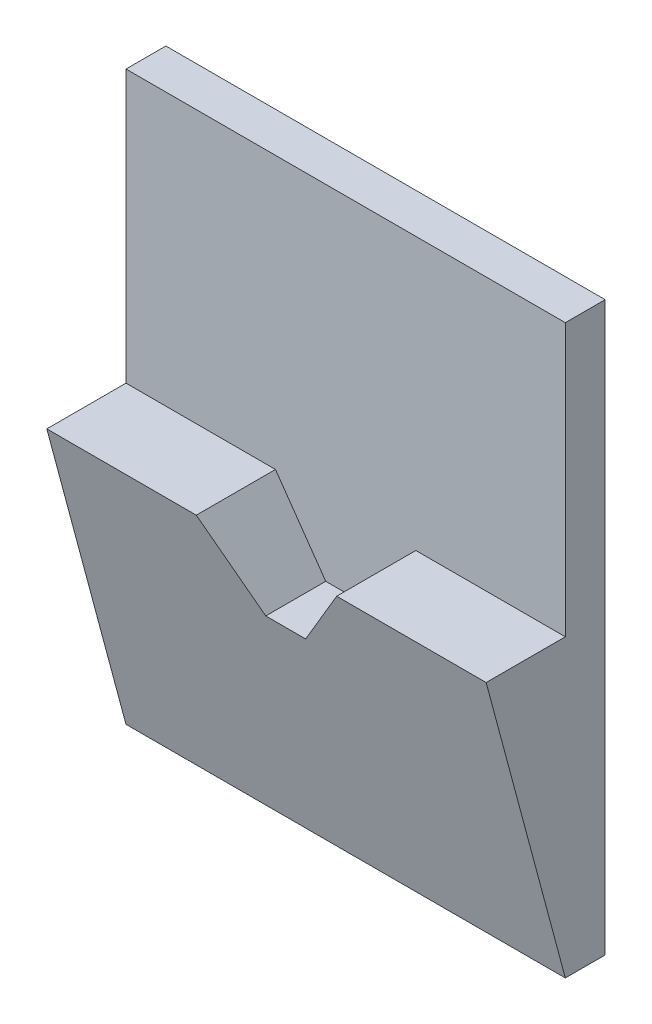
ISO-10303-21;
HEADER;
FILE_DESCRIPTION(('STEP AP214'),'2;1');
FILE_NAME('part.step','',(''),(''),'','','');
FILE_SCHEMA(('AUTOMOTIVE_DESIGN { 1 0 10303 214 1 1 1 1 }'));
ENDSEC;
DATA;
#1=APPLICATION_CONTEXT('core data for automotive mechanical design processes');
#2=APPLICATION_PROTOCOL_DEFINITION('international standard','automotive_design',2000,#1);
#3=PRODUCT_CONTEXT('',#1,'mechanical');
#4=PRODUCT('Part','Part','',(#3));
#5=PRODUCT_RELATED_PRODUCT_CATEGORY('part','',(#4));
#6=PRODUCT_DEFINITION_FORMATION('','',#4);
#7=PRODUCT_DEFINITION_CONTEXT('part definition',#1,'design');
#8=PRODUCT_DEFINITION('design','',#6,#7);
#9=PRODUCT_DEFINITION_SHAPE('','',#8);
#10=(LENGTH_UNIT() NAMED_UNIT(*) SI_UNIT(.MILLI.,.METRE.));
#11=(NAMED_UNIT(*) PLANE_ANGLE_UNIT() SI_UNIT($,.RADIAN.));
#12=(NAMED_UNIT(*) SI_UNIT($,.STERADIAN.) SOLID_ANGLE_UNIT());
#13=UNCERTAINTY_MEASURE_WITH_UNIT(LENGTH_MEASURE(1.E-05),#10,'distance_accuracy_value','');
#14=(GEOMETRIC_REPRESENTATION_CONTEXT(3) GLOBAL_UNCERTAINTY_ASSIGNED_CONTEXT((#13)) GLOBAL_UNIT_ASSIGNED_CONTEXT((#10,
#11,#12)) REPRESENTATION_CONTEXT('',''));
#15=CARTESIAN_POINT('',(0.,0.,0.));
#16=DIRECTION('',(0.,0.,1.));
#17=DIRECTION('',(1.,0.,0.));
#18=AXIS2_PLACEMENT_3D('',#15,#16,#17);
#19=CARTESIAN_POINT('',(-57.1808976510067,0.,5.08));
#20=DIRECTION('',(0.,1.,0.));
#21=DIRECTION('',(-1.,0.,0.));
#22=AXIS2_PLACEMENT_3D('',#19,#20,#21);
#23=PLANE('',#22);
#24=DIRECTION('',(-1.,0.,0.));
#25=VECTOR('',#24,1.);
#26=CARTESIAN_POINT('',(-57.1808976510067,0.,5.08));
#27=LINE('',#26,#25);
#28=CARTESIAN_POINT('',(-19.0808976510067,0.,5.08));
#29=VERTEX_POINT('',#28);
#30=CARTESIAN_POINT('',(-57.1808976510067,0.,5.08));
#31=VERTEX_POINT('',#30);
#32=EDGE_CURVE('E164',#29,#31,#27,.T.);
#33=ORIENTED_EDGE('',*,*,#32,.T.);
#34=DIRECTION('',(0.,0.,1.));
#35=VECTOR('',#34,1.);
#36=CARTESIAN_POINT('',(-57.1808976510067,0.,5.08));
#37=LINE('',#36,#35);
#38=CARTESIAN_POINT('',(-57.1808976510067,0.,25.2596358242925));
#39=VERTEX_POINT('',#38);
#40=EDGE_CURVE('E44',#31,#39,#37,.T.);
#41=ORIENTED_EDGE('',*,*,#40,.T.);
#42=DIRECTION('',(-1.,0.,0.));
#43=VECTOR('',#42,1.);
#44=CARTESIAN_POINT('',(-57.1808976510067,0.,25.2596358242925));
#45=LINE('',#44,#43);
#46=CARTESIAN_POINT('',(-19.0808976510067,0.,25.2596358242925));
#47=VERTEX_POINT('',#46);
#48=EDGE_CURVE('E151',#47,#39,#45,.T.);
#49=ORIENTED_EDGE('',*,*,#48,.F.);
#50=DIRECTION('',(0.,0.,1.));
#51=VECTOR('',#50,1.);
#52=CARTESIAN_POINT('',(-19.0808976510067,0.,5.08));
#53=LINE('',#52,#51);
#54=EDGE_CURVE('E152',#29,#47,#53,.T.);
#55=ORIENTED_EDGE('',*,*,#54,.F.);
#56=EDGE_LOOP('',(#33,#41,#49,#55));
#57=FACE_BOUND('',#56,.T.);
#58=ADVANCED_FACE('F37',(#57),#23,.T.);
#59=CARTESIAN_POINT('',(3.76938179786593,-32.6335810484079,5.08));
#60=DIRECTION('',(0.819152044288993,0.573576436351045,0.));
#61=DIRECTION('',(-0.573576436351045,0.819152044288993,0.));
#62=AXIS2_PLACEMENT_3D('',#59,#60,#61);
#63=PLANE('',#62);
#64=DIRECTION('',(-0.573576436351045,0.819152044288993,0.));
#65=VECTOR('',#64,1.);
#66=CARTESIAN_POINT('',(3.76938179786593,-32.6335810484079,5.08));
#67=LINE('',#66,#65);
#68=CARTESIAN_POINT('',(-6.27541946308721,-18.2881181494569,5.08));
#69=VERTEX_POINT('',#68);
#70=EDGE_CURVE('E168',#69,#29,#67,.T.);
#71=ORIENTED_EDGE('',*,*,#70,.T.);
#72=ORIENTED_EDGE('',*,*,#54,.T.);
#73=DIRECTION('',(-0.56024001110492,0.800105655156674,0.214387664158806));
#74=VECTOR('',#73,1.);
#75=CARTESIAN_POINT('',(5.14288238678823,-34.5951431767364,15.9898951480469));
#76=LINE('',#75,#74);
#77=CARTESIAN_POINT('',(-6.2754194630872,-18.2881181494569,20.3593493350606));
#78=VERTEX_POINT('',#77);
#79=EDGE_CURVE('E144',#78,#47,#76,.T.);
#80=ORIENTED_EDGE('',*,*,#79,.F.);
#81=DIRECTION('',(0.,0.,1.));
#82=VECTOR('',#81,1.);
#83=CARTESIAN_POINT('',(-6.27541946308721,-18.2881181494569,5.08));
#84=LINE('',#83,#82);
#85=EDGE_CURVE('E131',#69,#78,#84,.T.);
#86=ORIENTED_EDGE('',*,*,#85,.F.);
#87=EDGE_LOOP('',(#71,#72,#80,#86));
#88=FACE_BOUND('',#87,.T.);
#89=ADVANCED_FACE('F231',(#88),#63,.T.);
#90=CARTESIAN_POINT('',(-57.1808976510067,-18.2881181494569,5.08));
#91=DIRECTION('',(0.,1.,0.));
#92=DIRECTION('',(-1.,0.,0.));
#93=AXIS2_PLACEMENT_3D('',#90,#91,#92);
#94=PLANE('',#93);
#95=DIRECTION('',(-1.,0.,0.));
#96=VECTOR('',#95,1.);
#97=CARTESIAN_POINT('',(-57.1808976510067,-18.2881181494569,5.08));
#98=LINE('',#97,#96);
#99=CARTESIAN_POINT('',(3.88458053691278,-18.2881181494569,5.08));
#100=VERTEX_POINT('',#99);
#101=EDGE_CURVE('E201',#100,#69,#98,.T.);
#102=ORIENTED_EDGE('',*,*,#101,.T.);
#103=ORIENTED_EDGE('',*,*,#85,.T.);
#104=DIRECTION('',(-1.,0.,0.));
#105=VECTOR('',#104,1.);
#106=CARTESIAN_POINT('',(-57.1808976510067,-18.2881181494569,20.3593493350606));
#107=LINE('',#106,#105);
#108=CARTESIAN_POINT('',(3.88458053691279,-18.2881181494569,20.3593493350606));
#109=VERTEX_POINT('',#108);
#110=EDGE_CURVE('E126',#109,#78,#107,.T.);
#111=ORIENTED_EDGE('',*,*,#110,.F.);
#112=DIRECTION('',(0.,0.,1.));
#113=VECTOR('',#112,1.);
#114=CARTESIAN_POINT('',(3.88458053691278,-18.2881181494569,5.08));
#115=LINE('',#114,#113);
#116=EDGE_CURVE('E129',#100,#109,#115,.T.);
#117=ORIENTED_EDGE('',*,*,#116,.F.);
#118=EDGE_LOOP('',(#102,#103,#111,#117));
#119=FACE_BOUND('',#118,.T.);
#120=ADVANCED_FACE('F128',(#119),#94,.T.);
#121=CARTESIAN_POINT('',(-42.9975376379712,-85.2427217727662,5.08));
#122=DIRECTION('',(-0.819152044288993,0.573576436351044,0.));
#123=DIRECTION('',(-0.573576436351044,-0.819152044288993,0.));
#124=AXIS2_PLACEMENT_3D('',#121,#122,#123);
#125=PLANE('',#124);
#126=DIRECTION('',(-0.573576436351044,-0.819152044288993,0.));
#127=VECTOR('',#126,1.);
#128=CARTESIAN_POINT('',(-42.9975376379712,-85.2427217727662,5.08));
#129=LINE('',#128,#127);
#130=CARTESIAN_POINT('',(16.6900587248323,0.,5.08));
#131=VERTEX_POINT('',#130);
#132=EDGE_CURVE('E142',#131,#100,#129,.T.);
#133=ORIENTED_EDGE('',*,*,#132,.T.);
#134=ORIENTED_EDGE('',*,*,#116,.T.);
#135=DIRECTION('',(-0.560240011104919,-0.800105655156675,-0.214387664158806));
#136=VECTOR('',#135,1.);
#137=CARTESIAN_POINT('',(-42.6779188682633,-84.7862588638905,2.54122623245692));
#138=LINE('',#137,#136);
#139=CARTESIAN_POINT('',(16.6900587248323,0.,25.2596358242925));
#140=VERTEX_POINT('',#139);
#141=EDGE_CURVE('E121',#140,#109,#138,.T.);
#142=ORIENTED_EDGE('',*,*,#141,.F.);
#143=DIRECTION('',(0.,0.,1.));
#144=VECTOR('',#143,1.);
#145=CARTESIAN_POINT('',(16.6900587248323,0.,5.08));
#146=LINE('',#145,#144);
#147=EDGE_CURVE('E135',#131,#140,#146,.T.);
#148=ORIENTED_EDGE('',*,*,#147,.F.);
#149=EDGE_LOOP('',(#133,#134,#142,#148));
#150=FACE_BOUND('',#149,.T.);
#151=ADVANCED_FACE('F140',(#150),#125,.T.);
#152=CARTESIAN_POINT('',(-57.1808976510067,0.,5.08));
#153=DIRECTION('',(0.,1.,0.));
#154=DIRECTION('',(-1.,0.,0.));
#155=AXIS2_PLACEMENT_3D('',#152,#153,#154);
#156=PLANE('',#155);
#157=DIRECTION('',(-1.,0.,0.));
#158=VECTOR('',#157,1.);
#159=CARTESIAN_POINT('',(-57.1808976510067,0.,5.08));
#160=LINE('',#159,#158);
#161=CARTESIAN_POINT('',(54.7900587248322,0.,5.08));
#162=VERTEX_POINT('',#161);
#163=EDGE_CURVE('E195',#162,#131,#160,.T.);
#164=ORIENTED_EDGE('',*,*,#163,.T.);
#165=ORIENTED_EDGE('',*,*,#147,.T.);
#166=DIRECTION('',(-1.,0.,0.));
#167=VECTOR('',#166,1.);
#168=CARTESIAN_POINT('',(-57.1808976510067,0.,25.2596358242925));
#169=LINE('',#168,#167);
#170=CARTESIAN_POINT('',(54.7900587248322,0.,25.2596358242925));
#171=VERTEX_POINT('',#170);
#172=EDGE_CURVE('E51',#171,#140,#169,.T.);
#173=ORIENTED_EDGE('',*,*,#172,.F.);
#174=DIRECTION('',(0.,0.,1.));
#175=VECTOR('',#174,1.);
#176=CARTESIAN_POINT('',(54.7900587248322,0.,5.08));
#177=LINE('',#176,#175);
#178=EDGE_CURVE('E11',#162,#171,#177,.T.);
#179=ORIENTED_EDGE('',*,*,#178,.F.);
#180=EDGE_LOOP('',(#164,#165,#173,#179));
#181=FACE_BOUND('',#180,.T.);
#182=ADVANCED_FACE('F268',(#181),#156,.T.);
#183=CARTESIAN_POINT('',(-57.1808976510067,-75.3114261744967,5.08));
#184=DIRECTION('',(0.,-0.258819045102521,0.965925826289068));
#185=DIRECTION('',(0.,-0.965925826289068,-0.258819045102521));
#186=AXIS2_PLACEMENT_3D('',#183,#184,#185);
#187=PLANE('',#186);
#188=ORIENTED_EDGE('',*,*,#79,.T.);
#189=ORIENTED_EDGE('',*,*,#48,.T.);
#190=DIRECTION('',(0.,-0.965925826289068,-0.258819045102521));
#191=VECTOR('',#190,1.);
#192=CARTESIAN_POINT('',(-57.1808976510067,59.6449005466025,41.2414387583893));
#193=LINE('',#192,#191);
#194=CARTESIAN_POINT('',(-57.1808976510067,-75.3114261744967,5.08));
#195=VERTEX_POINT('',#194);
#196=EDGE_CURVE('E60',#39,#195,#193,.T.);
#197=ORIENTED_EDGE('',*,*,#196,.T.);
#198=DIRECTION('',(1.,0.,0.));
#199=VECTOR('',#198,1.);
#200=CARTESIAN_POINT('',(-57.1808976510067,-75.3114261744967,5.08));
#201=LINE('',#200,#199);
#202=CARTESIAN_POINT('',(54.7900587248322,-75.3114261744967,5.08));
#203=VERTEX_POINT('',#202);
#204=EDGE_CURVE('E161',#195,#203,#201,.T.);
#205=ORIENTED_EDGE('',*,*,#204,.T.);
#206=DIRECTION('',(0.,0.965925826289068,0.258819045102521));
#207=VECTOR('',#206,1.);
#208=CARTESIAN_POINT('',(54.7900587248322,59.6449005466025,41.2414387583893));
#209=LINE('',#208,#207);
#210=EDGE_CURVE('E158',#203,#171,#209,.T.);
#211=ORIENTED_EDGE('',*,*,#210,.T.);
#212=ORIENTED_EDGE('',*,*,#172,.T.);
#213=ORIENTED_EDGE('',*,*,#141,.T.);
#214=ORIENTED_EDGE('',*,*,#110,.T.);
#215=EDGE_LOOP('',(#188,#189,#197,#205,#211,#212,#213,#214));
#216=FACE_BOUND('',#215,.T.);
#217=ADVANCED_FACE('F137',(#216),#187,.T.);
#218=CARTESIAN_POINT('',(-57.1808976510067,69.3343288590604,5.08));
#219=DIRECTION('',(1.,0.,0.));
#220=DIRECTION('',(0.,0.,-1.));
#221=AXIS2_PLACEMENT_3D('',#218,#219,#220);
#222=PLANE('',#221);
#223=DIRECTION('',(0.,-1.,0.));
#224=VECTOR('',#223,1.);
#225=CARTESIAN_POINT('',(-57.1808976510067,69.3343288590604,-5.08));
#226=LINE('',#225,#224);
#227=CARTESIAN_POINT('',(-57.1808976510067,69.3343288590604,-5.08));
#228=VERTEX_POINT('',#227);
#229=CARTESIAN_POINT('',(-57.1808976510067,-75.3114261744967,-5.08));
#230=VERTEX_POINT('',#229);
#231=EDGE_CURVE('E177',#228,#230,#226,.T.);
#232=ORIENTED_EDGE('',*,*,#231,.T.);
#233=DIRECTION('',(0.,0.,-1.));
#234=VECTOR('',#233,1.);
#235=CARTESIAN_POINT('',(-57.1808976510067,-75.3114261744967,5.08));
#236=LINE('',#235,#234);
#237=EDGE_CURVE('E192',#195,#230,#236,.T.);
#238=ORIENTED_EDGE('',*,*,#237,.F.);
#239=ORIENTED_EDGE('',*,*,#196,.F.);
#240=ORIENTED_EDGE('',*,*,#40,.F.);
#241=DIRECTION('',(0.,-1.,0.));
#242=VECTOR('',#241,1.);
#243=CARTESIAN_POINT('',(-57.1808976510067,69.3343288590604,5.08));
#244=LINE('',#243,#242);
#245=CARTESIAN_POINT('',(-57.1808976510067,69.3343288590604,5.08));
#246=VERTEX_POINT('',#245);
#247=EDGE_CURVE('E156',#246,#31,#244,.T.);
#248=ORIENTED_EDGE('',*,*,#247,.F.);
#249=DIRECTION('',(0.,0.,-1.));
#250=VECTOR('',#249,1.);
#251=CARTESIAN_POINT('',(-57.1808976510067,69.3343288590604,5.08));
#252=LINE('',#251,#250);
#253=EDGE_CURVE('E176',#246,#228,#252,.T.);
#254=ORIENTED_EDGE('',*,*,#253,.T.);
#255=EDGE_LOOP('',(#232,#238,#239,#240,#248,#254));
#256=FACE_BOUND('',#255,.T.);
#257=ADVANCED_FACE('F243',(#256),#222,.F.);
#258=CARTESIAN_POINT('',(-57.1808976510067,-75.3114261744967,5.08));
#259=DIRECTION('',(0.,1.,0.));
#260=DIRECTION('',(0.,0.,1.));
#261=AXIS2_PLACEMENT_3D('',#258,#259,#260);
#262=PLANE('',#261);
#263=DIRECTION('',(1.,0.,0.));
#264=VECTOR('',#263,1.);
#265=CARTESIAN_POINT('',(-57.1808976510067,-75.3114261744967,-5.08));
#266=LINE('',#265,#264);
#267=CARTESIAN_POINT('',(54.7900587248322,-75.3114261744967,-5.08));
#268=VERTEX_POINT('',#267);
#269=EDGE_CURVE('E180',#230,#268,#266,.T.);
#270=ORIENTED_EDGE('',*,*,#269,.T.);
#271=DIRECTION('',(0.,0.,-1.));
#272=VECTOR('',#271,1.);
#273=CARTESIAN_POINT('',(54.7900587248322,-75.3114261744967,5.08));
#274=LINE('',#273,#272);
#275=EDGE_CURVE('E189',#203,#268,#274,.T.);
#276=ORIENTED_EDGE('',*,*,#275,.F.);
#277=ORIENTED_EDGE('',*,*,#204,.F.);
#278=ORIENTED_EDGE('',*,*,#237,.T.);
#279=EDGE_LOOP('',(#270,#276,#277,#278));
#280=FACE_BOUND('',#279,.T.);
#281=ADVANCED_FACE('F248',(#280),#262,.F.);
#282=CARTESIAN_POINT('',(54.7900587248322,69.3343288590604,5.08));
#283=DIRECTION('',(-1.,0.,0.));
#284=DIRECTION('',(0.,0.,1.));
#285=AXIS2_PLACEMENT_3D('',#282,#283,#284);
#286=PLANE('',#285);
#287=DIRECTION('',(0.,1.,0.));
#288=VECTOR('',#287,1.);
#289=CARTESIAN_POINT('',(54.7900587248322,69.3343288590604,-5.08));
#290=LINE('',#289,#288);
#291=CARTESIAN_POINT('',(54.7900587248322,69.3343288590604,-5.08));
#292=VERTEX_POINT('',#291);
#293=EDGE_CURVE('E182',#268,#292,#290,.T.);
#294=ORIENTED_EDGE('',*,*,#293,.T.);
#295=DIRECTION('',(0.,0.,-1.));
#296=VECTOR('',#295,1.);
#297=CARTESIAN_POINT('',(54.7900587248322,69.3343288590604,5.08));
#298=LINE('',#297,#296);
#299=CARTESIAN_POINT('',(54.7900587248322,69.3343288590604,5.08));
#300=VERTEX_POINT('',#299);
#301=EDGE_CURVE('E186',#300,#292,#298,.T.);
#302=ORIENTED_EDGE('',*,*,#301,.F.);
#303=DIRECTION('',(0.,1.,0.));
#304=VECTOR('',#303,1.);
#305=CARTESIAN_POINT('',(54.7900587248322,69.3343288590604,5.08));
#306=LINE('',#305,#304);
#307=EDGE_CURVE('E160',#162,#300,#306,.T.);
#308=ORIENTED_EDGE('',*,*,#307,.F.);
#309=ORIENTED_EDGE('',*,*,#178,.T.);
#310=ORIENTED_EDGE('',*,*,#210,.F.);
#311=ORIENTED_EDGE('',*,*,#275,.T.);
#312=EDGE_LOOP('',(#294,#302,#308,#309,#310,#311));
#313=FACE_BOUND('',#312,.T.);
#314=ADVANCED_FACE('F236',(#313),#286,.F.);
#315=CARTESIAN_POINT('',(-57.1808976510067,69.3343288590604,5.08));
#316=DIRECTION('',(0.,-1.,0.));
#317=DIRECTION('',(0.,0.,-1.));
#318=AXIS2_PLACEMENT_3D('',#315,#316,#317);
#319=PLANE('',#318);
#320=DIRECTION('',(-1.,0.,0.));
#321=VECTOR('',#320,1.);
#322=CARTESIAN_POINT('',(-57.1808976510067,69.3343288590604,-5.08));
#323=LINE('',#322,#321);
#324=EDGE_CURVE('E157',#292,#228,#323,.T.);
#325=ORIENTED_EDGE('',*,*,#324,.T.);
#326=ORIENTED_EDGE('',*,*,#253,.F.);
#327=DIRECTION('',(-1.,0.,0.));
#328=VECTOR('',#327,1.);
#329=CARTESIAN_POINT('',(-57.1808976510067,69.3343288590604,5.08));
#330=LINE('',#329,#328);
#331=EDGE_CURVE('E101',#300,#246,#330,.T.);
#332=ORIENTED_EDGE('',*,*,#331,.F.);
#333=ORIENTED_EDGE('',*,*,#301,.T.);
#334=EDGE_LOOP('',(#325,#326,#332,#333));
#335=FACE_BOUND('',#334,.T.);
#336=ADVANCED_FACE('F241',(#335),#319,.F.);
#337=CARTESIAN_POINT('',(-57.1808976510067,-75.3114261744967,5.08));
#338=DIRECTION('',(0.,0.,1.));
#339=DIRECTION('',(1.,0.,0.));
#340=AXIS2_PLACEMENT_3D('',#337,#338,#339);
#341=PLANE('',#340);
#342=ORIENTED_EDGE('',*,*,#32,.F.);
#343=ORIENTED_EDGE('',*,*,#70,.F.);
#344=ORIENTED_EDGE('',*,*,#101,.F.);
#345=ORIENTED_EDGE('',*,*,#132,.F.);
#346=ORIENTED_EDGE('',*,*,#163,.F.);
#347=ORIENTED_EDGE('',*,*,#307,.T.);
#348=ORIENTED_EDGE('',*,*,#331,.T.);
#349=ORIENTED_EDGE('',*,*,#247,.T.);
#350=EDGE_LOOP('',(#342,#343,#344,#345,#346,#347,#348,#349));
#351=FACE_BOUND('',#350,.T.);
#352=ADVANCED_FACE('F170',(#351),#341,.T.);
#353=CARTESIAN_POINT('',(-57.1808976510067,-75.3114261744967,-5.08));
#354=DIRECTION('',(0.,0.,1.));
#355=DIRECTION('',(1.,0.,0.));
#356=AXIS2_PLACEMENT_3D('',#353,#354,#355);
#357=PLANE('',#356);
#358=ORIENTED_EDGE('',*,*,#231,.F.);
#359=ORIENTED_EDGE('',*,*,#324,.F.);
#360=ORIENTED_EDGE('',*,*,#293,.F.);
#361=ORIENTED_EDGE('',*,*,#269,.F.);
#362=EDGE_LOOP('',(#358,#359,#360,#361));
#363=FACE_BOUND('',#362,.T.);
#364=ADVANCED_FACE('F245',(#363),#357,.F.);
#365=CLOSED_SHELL('',(#58,#89,#120,#151,#182,#217,#257,#281,#314,#336,#352,#364));
#366=MANIFOLD_SOLID_BREP('B2',#365);
#367=ADVANCED_BREP_SHAPE_REPRESENTATION('',(#18,#366),#14);
#368=SHAPE_DEFINITION_REPRESENTATION(#9,#367);
ENDSEC;
END-ISO-10303-21;
